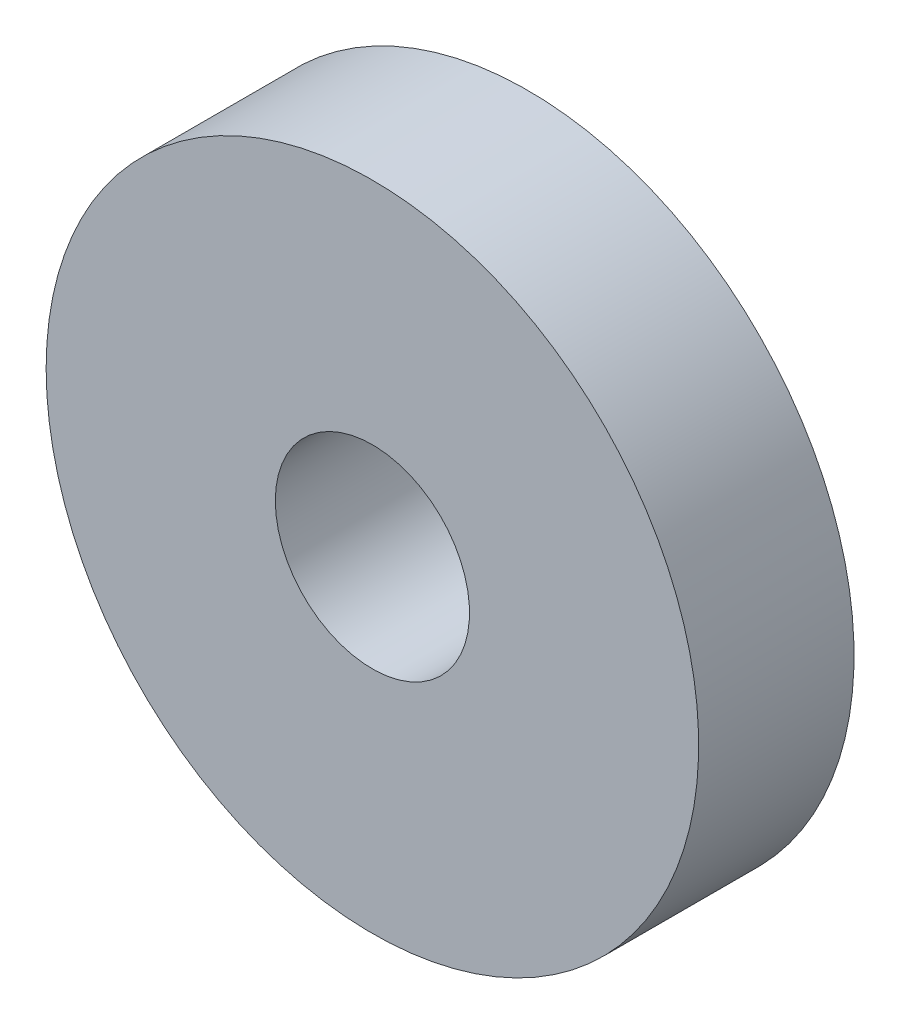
ISO-10303-21;
HEADER;
FILE_DESCRIPTION(('STEP AP214'),'2;1');
FILE_NAME('part.step','',(''),(''),'','','');
FILE_SCHEMA(('AUTOMOTIVE_DESIGN { 1 0 10303 214 1 1 1 1 }'));
ENDSEC;
DATA;
#1=APPLICATION_CONTEXT('core data for automotive mechanical design processes');
#2=APPLICATION_PROTOCOL_DEFINITION('international standard','automotive_design',2000,#1);
#3=PRODUCT_CONTEXT('',#1,'mechanical');
#4=PRODUCT('Part','Part','',(#3));
#5=PRODUCT_RELATED_PRODUCT_CATEGORY('part','',(#4));
#6=PRODUCT_DEFINITION_FORMATION('','',#4);
#7=PRODUCT_DEFINITION_CONTEXT('part definition',#1,'design');
#8=PRODUCT_DEFINITION('design','',#6,#7);
#9=PRODUCT_DEFINITION_SHAPE('','',#8);
#10=(LENGTH_UNIT() NAMED_UNIT(*) SI_UNIT(.MILLI.,.METRE.));
#11=(NAMED_UNIT(*) PLANE_ANGLE_UNIT() SI_UNIT($,.RADIAN.));
#12=(NAMED_UNIT(*) SI_UNIT($,.STERADIAN.) SOLID_ANGLE_UNIT());
#13=UNCERTAINTY_MEASURE_WITH_UNIT(LENGTH_MEASURE(1.E-05),#10,'distance_accuracy_value','');
#14=(GEOMETRIC_REPRESENTATION_CONTEXT(3) GLOBAL_UNCERTAINTY_ASSIGNED_CONTEXT((#13)) GLOBAL_UNIT_ASSIGNED_CONTEXT((#10,
#11,#12)) REPRESENTATION_CONTEXT('',''));
#15=CARTESIAN_POINT('',(0.,0.,0.));
#16=DIRECTION('',(0.,0.,1.));
#17=DIRECTION('',(1.,0.,0.));
#18=AXIS2_PLACEMENT_3D('',#15,#16,#17);
#19=CARTESIAN_POINT('',(0.,0.,0.));
#20=DIRECTION('',(0.,0.,-1.));
#21=DIRECTION('',(-1.,0.,0.));
#22=AXIS2_PLACEMENT_3D('',#19,#20,#21);
#23=PLANE('',#22);
#24=CARTESIAN_POINT('',(0.,0.,0.));
#25=DIRECTION('',(0.,0.,-1.));
#26=DIRECTION('',(-1.,0.,0.));
#27=AXIS2_PLACEMENT_3D('',#24,#25,#26);
#28=CIRCLE('',#27,6.25);
#29=CARTESIAN_POINT('',(-6.25,0.,0.));
#30=VERTEX_POINT('',#29);
#31=EDGE_CURVE('E43',#30,#30,#28,.T.);
#32=ORIENTED_EDGE('',*,*,#31,.T.);
#33=EDGE_LOOP('',(#32));
#34=FACE_BOUND('',#33,.T.);
#35=CARTESIAN_POINT('',(0.,0.,0.));
#36=DIRECTION('',(0.,0.,-1.));
#37=DIRECTION('',(-1.,0.,0.));
#38=AXIS2_PLACEMENT_3D('',#35,#36,#37);
#39=CIRCLE('',#38,21.);
#40=CARTESIAN_POINT('',(-21.,0.,0.));
#41=VERTEX_POINT('',#40);
#42=EDGE_CURVE('E10',#41,#41,#39,.T.);
#43=ORIENTED_EDGE('',*,*,#42,.F.);
#44=EDGE_LOOP('',(#43));
#45=FACE_BOUND('',#44,.T.);
#46=ADVANCED_FACE('F33',(#34,#45),#23,.F.);
#47=CARTESIAN_POINT('',(0.,0.,0.));
#48=DIRECTION('',(0.,0.,-1.));
#49=DIRECTION('',(-1.,0.,0.));
#50=AXIS2_PLACEMENT_3D('',#47,#48,#49);
#51=CYLINDRICAL_SURFACE('',#50,21.);
#52=CARTESIAN_POINT('',(0.,0.,-10.));
#53=DIRECTION('',(0.,0.,-1.));
#54=DIRECTION('',(-1.,0.,0.));
#55=AXIS2_PLACEMENT_3D('',#52,#53,#54);
#56=CIRCLE('',#55,21.);
#57=CARTESIAN_POINT('',(-21.,0.,-10.));
#58=VERTEX_POINT('',#57);
#59=EDGE_CURVE('E39',#58,#58,#56,.T.);
#60=ORIENTED_EDGE('',*,*,#59,.F.);
#61=EDGE_LOOP('',(#60));
#62=FACE_BOUND('',#61,.T.);
#63=ORIENTED_EDGE('',*,*,#42,.T.);
#64=EDGE_LOOP('',(#63));
#65=FACE_BOUND('',#64,.T.);
#66=ADVANCED_FACE('F58',(#62,#65),#51,.T.);
#67=CARTESIAN_POINT('',(0.,0.,-10.));
#68=DIRECTION('',(0.,0.,1.));
#69=DIRECTION('',(1.,0.,0.));
#70=AXIS2_PLACEMENT_3D('',#67,#68,#69);
#71=PLANE('',#70);
#72=CARTESIAN_POINT('',(0.,0.,-10.));
#73=DIRECTION('',(0.,0.,-1.));
#74=DIRECTION('',(-1.,0.,0.));
#75=AXIS2_PLACEMENT_3D('',#72,#73,#74);
#76=CIRCLE('',#75,6.25);
#77=CARTESIAN_POINT('',(-6.25,0.,-10.));
#78=VERTEX_POINT('',#77);
#79=EDGE_CURVE('E47',#78,#78,#76,.T.);
#80=ORIENTED_EDGE('',*,*,#79,.F.);
#81=EDGE_LOOP('',(#80));
#82=FACE_BOUND('',#81,.T.);
#83=ORIENTED_EDGE('',*,*,#59,.T.);
#84=EDGE_LOOP('',(#83));
#85=FACE_BOUND('',#84,.T.);
#86=ADVANCED_FACE('F56',(#82,#85),#71,.F.);
#87=CARTESIAN_POINT('',(0.,0.,0.));
#88=DIRECTION('',(0.,0.,-1.));
#89=DIRECTION('',(-1.,0.,0.));
#90=AXIS2_PLACEMENT_3D('',#87,#88,#89);
#91=CYLINDRICAL_SURFACE('',#90,6.25);
#92=ORIENTED_EDGE('',*,*,#79,.T.);
#93=EDGE_LOOP('',(#92));
#94=FACE_BOUND('',#93,.T.);
#95=ORIENTED_EDGE('',*,*,#31,.F.);
#96=EDGE_LOOP('',(#95));
#97=FACE_BOUND('',#96,.T.);
#98=ADVANCED_FACE('F53',(#94,#97),#91,.F.);
#99=CLOSED_SHELL('',(#46,#66,#86,#98));
#100=MANIFOLD_SOLID_BREP('B2',#99);
#101=ADVANCED_BREP_SHAPE_REPRESENTATION('',(#18,#100),#14);
#102=SHAPE_DEFINITION_REPRESENTATION(#9,#101);
ENDSEC;
END-ISO-10303-21;
